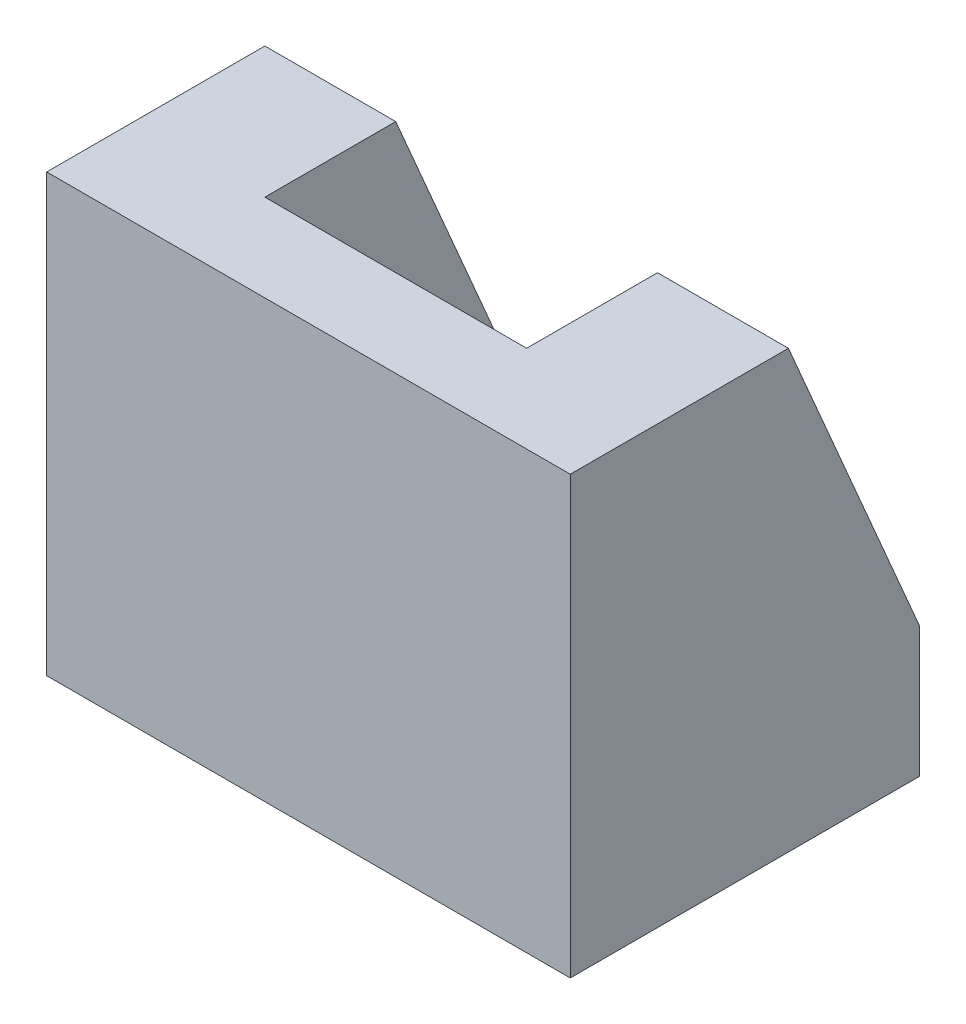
from build123d import *

# Parameters (mm, degrees)
EXTRUDE_1_DEPTH     = 120
SKETCH_2_W          = 60
SKETCH_2_H          = 60
CUT_EXTRUDE_1_DEPTH = 70


with BuildPart() as part:
    # Sketch 1 → Extrude 1 (new body)
    with BuildSketch(Plane(origin=(0, 0, 0), x_dir=(0, 0, -1), z_dir=(1, 0, 0))):
        Polygon((50, 100), (80, 30), (80, 0), (0, 0), (0, 100), align=None)
    extrude(amount=EXTRUDE_1_DEPTH)

    # Sketch 2 → Cut-Extrude 1 (cut)
    with BuildSketch(Plane(origin=(0, 100, 0), x_dir=(1, 0, 0), z_dir=(0, 1, 0))):
        with Locations((60, 50)):
            Rectangle(SKETCH_2_W, SKETCH_2_H)
    extrude(amount=-CUT_EXTRUDE_1_DEPTH, mode=Mode.SUBTRACT)


solid = part.part
